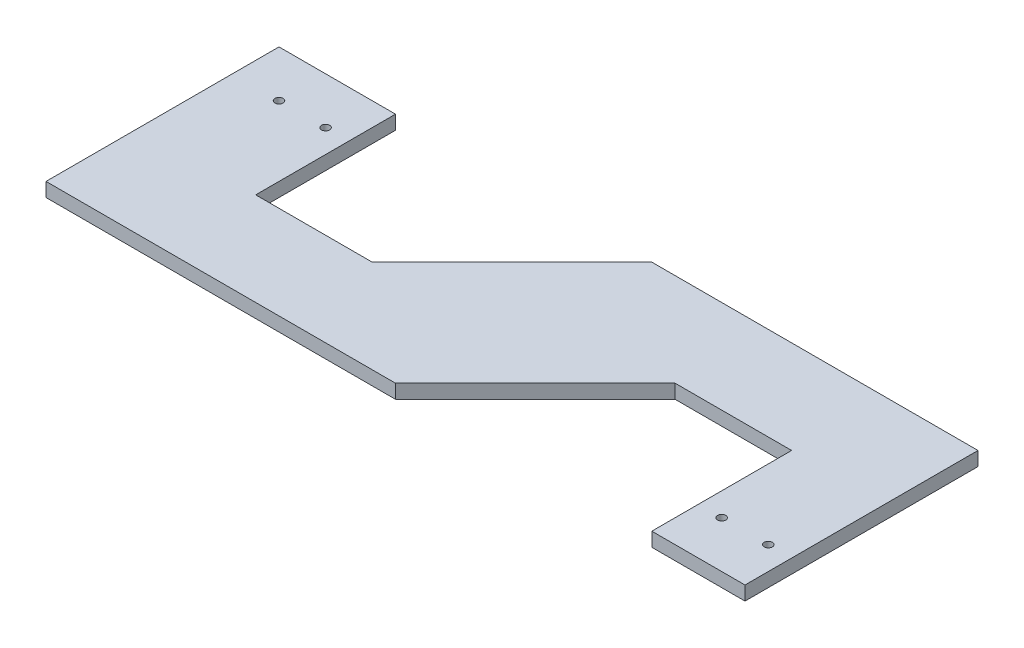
from build123d import *

# Parameters (mm, degrees)
SKETCH1_R      = 1.75
EXTRUDE1_DEPTH = 6
SKETCH2_R      = 3.25
EXTRUDE2_DEPTH = 3


with BuildPart() as part:
    # Sketch1 → Extrude1 (new body)
    with BuildSketch(Plane(origin=(0, 0, 0), x_dir=(1, 0, 0), z_dir=(0, 1, 0))):
        Polygon((260, 0), (260, 60), (210, 60), (150, 0), (0, 0), (0, 100), (50, 100), (50, 40), (100, 40), (160, 100), (300, 100), (300, 0), align=None)
        with Locations(Location((20, 80, 0), (0, 0, 270))):
            Circle(SKETCH1_R, mode=Mode.SUBTRACT)
        with Locations(Location((290, 20, 0), (0, 0, 270))):
            Circle(SKETCH1_R, mode=Mode.SUBTRACT)
        with Locations(Location((40, 80, 0), (0, 0, 270))):
            Circle(SKETCH1_R, mode=Mode.SUBTRACT)
        with Locations(Location((270, 20, 0), (0, 0, 270))):
            Circle(SKETCH1_R, mode=Mode.SUBTRACT)
    extrude(amount=EXTRUDE1_DEPTH)

    # Sketch2 → Extrude2 (cut)
    with BuildSketch(Plane.XZ):
        with Locations(Location((290, -20, 0), (0, 0, 270))):
            Circle(SKETCH2_R)
        with Locations(Location((270, -20, 0), (0, 0, 270))):
            Circle(SKETCH2_R)
        with Locations(Location((40, -80, 0), (0, 0, 270))):
            Circle(SKETCH2_R)
        with Locations(Location((20, -80, 0), (0, 0, 270))):
            Circle(SKETCH2_R)
    extrude(amount=-EXTRUDE2_DEPTH, mode=Mode.SUBTRACT)


solid = part.part
